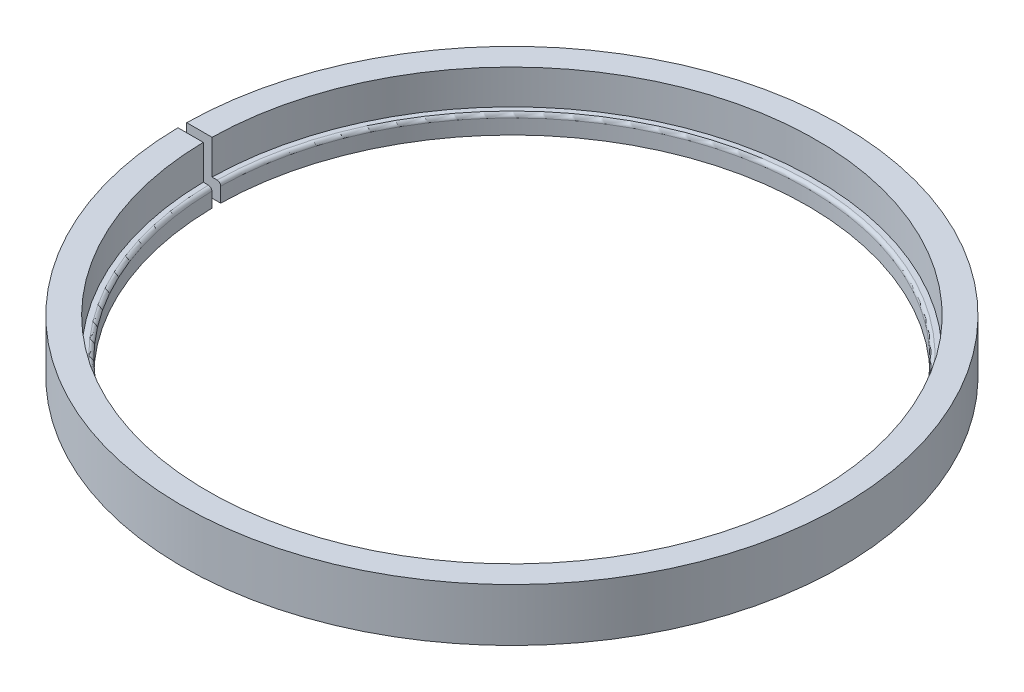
from build123d import *

# Parameters (mm, degrees)
SKETCH4_W          = 42.225361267
SKETCH4_H          = 3.175
CUT_EXTRUDE1_DEPTH = 170.275541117


with BuildPart() as part:
    # Sketch1 → Revolve1 (revolve)
    with BuildSketch(Plane.XY, mode=Mode.PRIVATE) as revolve1_sk:
        with BuildLine():
            Line((-118.9355, 6.096), (-106.6927, 6.096))
            Line((-106.6927, 6.096), (-106.6927, 11.43))
            ThreePointArc((-106.6927, 11.43), (-107.064674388, 12.328025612), (-107.9627, 12.7))
            Line((-107.9627, 12.7), (-109.7915, 12.7))
            Line((-109.7915, 12.7), (-109.7915, 25.146))
            Line((-109.7915, 25.146), (-118.9355, 25.146))
            Line((-118.9355, 25.146), (-118.9355, 6.096))
        make_face()
    revolve(revolve1_sk.sketch.rotate(Axis((0, 0, 0), (0, 1, 0)), 270), axis=Axis((0, 0, 0), (0, 1, 0)))

    # Sketch4 → Cut-Extrude1 (cut, through all)
    with BuildSketch(Plane(origin=(0, 25.146, 0), x_dir=(1, 0, 0), z_dir=(0, 1, 0))):
        with Locations((-113.944482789, 0)):
            Rectangle(SKETCH4_W, SKETCH4_H)
    extrude(amount=-CUT_EXTRUDE1_DEPTH, mode=Mode.SUBTRACT)


solid = part.part
